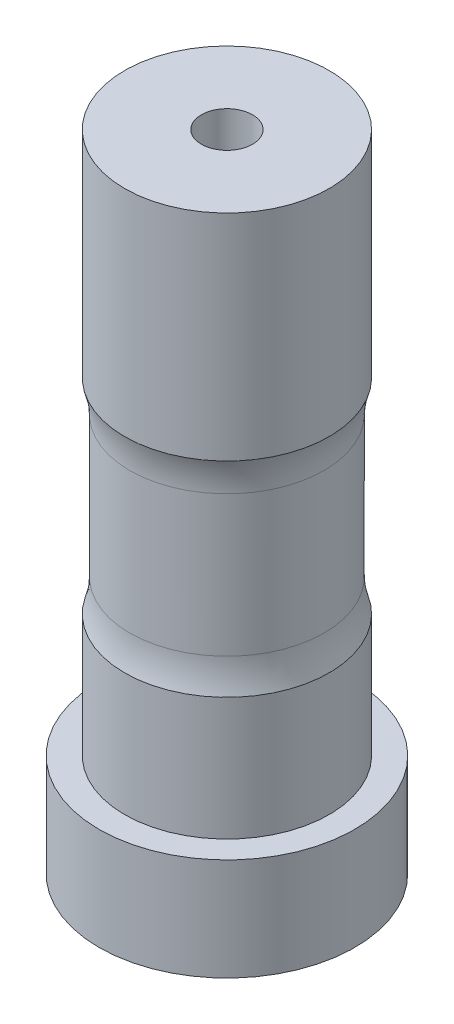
ISO-10303-21;
HEADER;
FILE_DESCRIPTION(('STEP AP214'),'2;1');
FILE_NAME('part.step','',(''),(''),'','','');
FILE_SCHEMA(('AUTOMOTIVE_DESIGN { 1 0 10303 214 1 1 1 1 }'));
ENDSEC;
DATA;
#1=APPLICATION_CONTEXT('core data for automotive mechanical design processes');
#2=APPLICATION_PROTOCOL_DEFINITION('international standard','automotive_design',2000,#1);
#3=PRODUCT_CONTEXT('',#1,'mechanical');
#4=PRODUCT('Part','Part','',(#3));
#5=PRODUCT_RELATED_PRODUCT_CATEGORY('part','',(#4));
#6=PRODUCT_DEFINITION_FORMATION('','',#4);
#7=PRODUCT_DEFINITION_CONTEXT('part definition',#1,'design');
#8=PRODUCT_DEFINITION('design','',#6,#7);
#9=PRODUCT_DEFINITION_SHAPE('','',#8);
#10=(LENGTH_UNIT() NAMED_UNIT(*) SI_UNIT(.MILLI.,.METRE.));
#11=(NAMED_UNIT(*) PLANE_ANGLE_UNIT() SI_UNIT($,.RADIAN.));
#12=(NAMED_UNIT(*) SI_UNIT($,.STERADIAN.) SOLID_ANGLE_UNIT());
#13=UNCERTAINTY_MEASURE_WITH_UNIT(LENGTH_MEASURE(1.E-05),#10,'distance_accuracy_value','');
#14=(GEOMETRIC_REPRESENTATION_CONTEXT(3) GLOBAL_UNCERTAINTY_ASSIGNED_CONTEXT((#13)) GLOBAL_UNIT_ASSIGNED_CONTEXT((#10,
#11,#12)) REPRESENTATION_CONTEXT('',''));
#15=CARTESIAN_POINT('',(0.,0.,0.));
#16=DIRECTION('',(0.,0.,1.));
#17=DIRECTION('',(1.,0.,0.));
#18=AXIS2_PLACEMENT_3D('',#15,#16,#17);
#19=CARTESIAN_POINT('',(0.,35.3991360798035,0.));
#20=DIRECTION('',(0.,1.,0.));
#21=DIRECTION('',(0.,0.,1.));
#22=AXIS2_PLACEMENT_3D('',#19,#20,#21);
#23=CYLINDRICAL_SURFACE('',#22,9.49999999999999);
#24=CARTESIAN_POINT('',(0.,-2.47836492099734,0.));
#25=DIRECTION('',(0.,-1.,0.));
#26=DIRECTION('',(0.,0.,-1.));
#27=AXIS2_PLACEMENT_3D('',#24,#25,#26);
#28=CIRCLE('',#27,9.49999999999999);
#29=CARTESIAN_POINT('',(0.,-2.47836492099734,-9.5));
#30=VERTEX_POINT('',#29);
#31=EDGE_CURVE('E11',#30,#30,#28,.F.);
#32=ORIENTED_EDGE('',*,*,#31,.T.);
#33=EDGE_LOOP('',(#32));
#34=FACE_BOUND('',#33,.T.);
#35=CARTESIAN_POINT('',(0.,11.2766370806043,0.));
#36=DIRECTION('',(0.,1.,0.));
#37=DIRECTION('',(0.,0.,1.));
#38=AXIS2_PLACEMENT_3D('',#35,#36,#37);
#39=CIRCLE('',#38,9.49999999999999);
#40=CARTESIAN_POINT('',(0.,11.2766370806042,9.49999999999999));
#41=VERTEX_POINT('',#40);
#42=EDGE_CURVE('E39',#41,#41,#39,.F.);
#43=ORIENTED_EDGE('',*,*,#42,.T.);
#44=EDGE_LOOP('',(#43));
#45=FACE_BOUND('',#44,.T.);
#46=ADVANCED_FACE('F32',(#34,#45),#23,.T.);
#47=CARTESIAN_POINT('',(0.,35.3991360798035,0.));
#48=DIRECTION('',(0.,1.,0.));
#49=DIRECTION('',(0.,0.,1.));
#50=AXIS2_PLACEMENT_3D('',#47,#48,#49);
#51=CYLINDRICAL_SURFACE('',#50,9.99999999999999);
#52=CARTESIAN_POINT('',(0.,-5.60086392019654,0.));
#53=DIRECTION('',(0.,1.,0.));
#54=DIRECTION('',(0.,0.,1.));
#55=AXIS2_PLACEMENT_3D('',#52,#53,#54);
#56=CIRCLE('',#55,10.);
#57=CARTESIAN_POINT('',(0.,-5.60086392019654,9.99999999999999));
#58=VERTEX_POINT('',#57);
#59=EDGE_CURVE('E77',#58,#58,#56,.T.);
#60=ORIENTED_EDGE('',*,*,#59,.F.);
#61=EDGE_LOOP('',(#60));
#62=FACE_BOUND('',#61,.T.);
#63=CARTESIAN_POINT('',(0.,-17.6008639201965,0.));
#64=DIRECTION('',(0.,1.,0.));
#65=DIRECTION('',(0.,0.,1.));
#66=AXIS2_PLACEMENT_3D('',#63,#64,#65);
#67=CIRCLE('',#66,9.99999999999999);
#68=CARTESIAN_POINT('',(0.,-17.6008639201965,9.99999999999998));
#69=VERTEX_POINT('',#68);
#70=EDGE_CURVE('E74',#69,#69,#67,.T.);
#71=ORIENTED_EDGE('',*,*,#70,.T.);
#72=EDGE_LOOP('',(#71));
#73=FACE_BOUND('',#72,.T.);
#74=ADVANCED_FACE('F103',(#62,#73),#51,.T.);
#75=CARTESIAN_POINT('',(0.,-17.6008639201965,-10.));
#76=DIRECTION('',(0.,-1.,0.));
#77=DIRECTION('',(0.,0.,-1.));
#78=AXIS2_PLACEMENT_3D('',#75,#76,#77);
#79=PLANE('',#78);
#80=ORIENTED_EDGE('',*,*,#70,.F.);
#81=EDGE_LOOP('',(#80));
#82=FACE_BOUND('',#81,.T.);
#83=CARTESIAN_POINT('',(0.,-17.6008639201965,0.));
#84=DIRECTION('',(0.,1.,0.));
#85=DIRECTION('',(0.,0.,1.));
#86=AXIS2_PLACEMENT_3D('',#83,#84,#85);
#87=CIRCLE('',#86,12.5);
#88=CARTESIAN_POINT('',(0.,-17.6008639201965,12.5));
#89=VERTEX_POINT('',#88);
#90=EDGE_CURVE('E71',#89,#89,#87,.T.);
#91=ORIENTED_EDGE('',*,*,#90,.T.);
#92=EDGE_LOOP('',(#91));
#93=FACE_BOUND('',#92,.T.);
#94=ADVANCED_FACE('F109',(#82,#93),#79,.F.);
#95=CARTESIAN_POINT('',(0.,35.3991360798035,0.));
#96=DIRECTION('',(0.,1.,0.));
#97=DIRECTION('',(0.,0.,1.));
#98=AXIS2_PLACEMENT_3D('',#95,#96,#97);
#99=CYLINDRICAL_SURFACE('',#98,12.5);
#100=ORIENTED_EDGE('',*,*,#90,.F.);
#101=EDGE_LOOP('',(#100));
#102=FACE_BOUND('',#101,.T.);
#103=CARTESIAN_POINT('',(0.,-27.6008639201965,0.));
#104=DIRECTION('',(0.,1.,0.));
#105=DIRECTION('',(0.,0.,1.));
#106=AXIS2_PLACEMENT_3D('',#103,#104,#105);
#107=CIRCLE('',#106,12.5);
#108=CARTESIAN_POINT('',(0.,-27.6008639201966,12.5));
#109=VERTEX_POINT('',#108);
#110=EDGE_CURVE('E68',#109,#109,#107,.T.);
#111=ORIENTED_EDGE('',*,*,#110,.T.);
#112=EDGE_LOOP('',(#111));
#113=FACE_BOUND('',#112,.T.);
#114=ADVANCED_FACE('F115',(#102,#113),#99,.T.);
#115=CARTESIAN_POINT('',(0.,-27.6008639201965,-12.5));
#116=DIRECTION('',(0.,1.,0.));
#117=DIRECTION('',(0.,0.,1.));
#118=AXIS2_PLACEMENT_3D('',#115,#116,#117);
#119=PLANE('',#118);
#120=ORIENTED_EDGE('',*,*,#110,.F.);
#121=EDGE_LOOP('',(#120));
#122=FACE_BOUND('',#121,.T.);
#123=CARTESIAN_POINT('',(0.,-27.6008639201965,0.));
#124=DIRECTION('',(0.,1.,0.));
#125=DIRECTION('',(0.,0.,1.));
#126=AXIS2_PLACEMENT_3D('',#123,#124,#125);
#127=CIRCLE('',#126,9.99999999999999);
#128=CARTESIAN_POINT('',(0.,-27.6008639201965,9.99999999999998));
#129=VERTEX_POINT('',#128);
#130=EDGE_CURVE('E65',#129,#129,#127,.T.);
#131=ORIENTED_EDGE('',*,*,#130,.T.);
#132=EDGE_LOOP('',(#131));
#133=FACE_BOUND('',#132,.T.);
#134=ADVANCED_FACE('F119',(#122,#133),#119,.F.);
#135=CARTESIAN_POINT('',(0.,35.3991360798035,0.));
#136=DIRECTION('',(0.,1.,0.));
#137=DIRECTION('',(0.,0.,1.));
#138=AXIS2_PLACEMENT_3D('',#135,#136,#137);
#139=CYLINDRICAL_SURFACE('',#138,9.99999999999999);
#140=ORIENTED_EDGE('',*,*,#130,.F.);
#141=EDGE_LOOP('',(#140));
#142=FACE_BOUND('',#141,.T.);
#143=CARTESIAN_POINT('',(0.,-29.1008639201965,0.));
#144=DIRECTION('',(0.,1.,0.));
#145=DIRECTION('',(0.,0.,1.));
#146=AXIS2_PLACEMENT_3D('',#143,#144,#145);
#147=CIRCLE('',#146,9.99999999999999);
#148=CARTESIAN_POINT('',(0.,-29.1008639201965,9.99999999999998));
#149=VERTEX_POINT('',#148);
#150=EDGE_CURVE('E62',#149,#149,#147,.T.);
#151=ORIENTED_EDGE('',*,*,#150,.T.);
#152=EDGE_LOOP('',(#151));
#153=FACE_BOUND('',#152,.T.);
#154=ADVANCED_FACE('F123',(#142,#153),#139,.T.);
#155=CARTESIAN_POINT('',(0.,-29.1008639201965,-10.));
#156=DIRECTION('',(0.,1.,0.));
#157=DIRECTION('',(0.,0.,1.));
#158=AXIS2_PLACEMENT_3D('',#155,#156,#157);
#159=PLANE('',#158);
#160=ORIENTED_EDGE('',*,*,#150,.F.);
#161=EDGE_LOOP('',(#160));
#162=FACE_BOUND('',#161,.T.);
#163=ADVANCED_FACE('F98',(#162),#159,.F.);
#164=CARTESIAN_POINT('',(0.,35.3991360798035,-10.));
#165=DIRECTION('',(0.,-1.,0.));
#166=DIRECTION('',(0.,0.,-1.));
#167=AXIS2_PLACEMENT_3D('',#164,#165,#166);
#168=PLANE('',#167);
#169=CARTESIAN_POINT('',(0.,35.3991360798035,0.));
#170=DIRECTION('',(0.,1.,0.));
#171=DIRECTION('',(0.,0.,1.));
#172=AXIS2_PLACEMENT_3D('',#169,#170,#171);
#173=CIRCLE('',#172,2.5);
#174=CARTESIAN_POINT('',(0.,35.3991360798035,2.5));
#175=VERTEX_POINT('',#174);
#176=EDGE_CURVE('E52',#175,#175,#173,.T.);
#177=ORIENTED_EDGE('',*,*,#176,.F.);
#178=EDGE_LOOP('',(#177));
#179=FACE_BOUND('',#178,.T.);
#180=CARTESIAN_POINT('',(0.,35.3991360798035,0.));
#181=DIRECTION('',(0.,1.,0.));
#182=DIRECTION('',(0.,0.,1.));
#183=AXIS2_PLACEMENT_3D('',#180,#181,#182);
#184=CIRCLE('',#183,10.);
#185=CARTESIAN_POINT('',(0.,35.3991360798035,10.));
#186=VERTEX_POINT('',#185);
#187=EDGE_CURVE('E55',#186,#186,#184,.T.);
#188=ORIENTED_EDGE('',*,*,#187,.T.);
#189=EDGE_LOOP('',(#188));
#190=FACE_BOUND('',#189,.T.);
#191=ADVANCED_FACE('F90',(#179,#190),#168,.F.);
#192=CARTESIAN_POINT('',(0.,35.3991360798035,0.));
#193=DIRECTION('',(0.,1.,0.));
#194=DIRECTION('',(0.,0.,1.));
#195=AXIS2_PLACEMENT_3D('',#192,#193,#194);
#196=CYLINDRICAL_SURFACE('',#195,9.99999999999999);
#197=ORIENTED_EDGE('',*,*,#187,.F.);
#198=EDGE_LOOP('',(#197));
#199=FACE_BOUND('',#198,.T.);
#200=CARTESIAN_POINT('',(0.,14.3991360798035,0.));
#201=DIRECTION('',(0.,1.,0.));
#202=DIRECTION('',(0.,0.,1.));
#203=AXIS2_PLACEMENT_3D('',#200,#201,#202);
#204=CIRCLE('',#203,9.99999999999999);
#205=CARTESIAN_POINT('',(0.,14.3991360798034,9.99999999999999));
#206=VERTEX_POINT('',#205);
#207=EDGE_CURVE('E51',#206,#206,#204,.T.);
#208=ORIENTED_EDGE('',*,*,#207,.T.);
#209=EDGE_LOOP('',(#208));
#210=FACE_BOUND('',#209,.T.);
#211=ADVANCED_FACE('F88',(#199,#210),#196,.T.);
#212=CARTESIAN_POINT('',(0.,-2.47836492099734,0.));
#213=DIRECTION('',(0.,-1.,0.));
#214=DIRECTION('',(0.,0.,-1.));
#215=AXIS2_PLACEMENT_3D('',#212,#213,#214);
#216=TOROIDAL_SURFACE('',#215,19.5,10.);
#217=ORIENTED_EDGE('',*,*,#59,.T.);
#218=EDGE_LOOP('',(#217));
#219=FACE_BOUND('',#218,.T.);
#220=ORIENTED_EDGE('',*,*,#31,.F.);
#221=EDGE_LOOP('',(#220));
#222=FACE_BOUND('',#221,.T.);
#223=ADVANCED_FACE('F85',(#219,#222),#216,.F.);
#224=CARTESIAN_POINT('',(0.,11.2766370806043,0.));
#225=DIRECTION('',(0.,1.,0.));
#226=DIRECTION('',(0.,0.,1.));
#227=AXIS2_PLACEMENT_3D('',#224,#225,#226);
#228=TOROIDAL_SURFACE('',#227,19.5,10.);
#229=ORIENTED_EDGE('',*,*,#42,.F.);
#230=EDGE_LOOP('',(#229));
#231=FACE_BOUND('',#230,.T.);
#232=ORIENTED_EDGE('',*,*,#207,.F.);
#233=EDGE_LOOP('',(#232));
#234=FACE_BOUND('',#233,.T.);
#235=ADVANCED_FACE('F34',(#231,#234),#228,.F.);
#236=CARTESIAN_POINT('',(0.,15.3991360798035,0.));
#237=DIRECTION('',(0.,1.,0.));
#238=DIRECTION('',(0.,0.,1.));
#239=AXIS2_PLACEMENT_3D('',#236,#237,#238);
#240=CONICAL_SURFACE('',#239,2.5,1.02974425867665);
#241=CARTESIAN_POINT('',(0.,13.8969845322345,0.));
#242=VERTEX_POINT('',#241);
#243=VERTEX_LOOP('',#242);
#244=FACE_BOUND('',#243,.T.);
#245=CARTESIAN_POINT('',(0.,15.3991360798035,0.));
#246=DIRECTION('',(0.,1.,0.));
#247=DIRECTION('',(0.,0.,1.));
#248=AXIS2_PLACEMENT_3D('',#245,#246,#247);
#249=CIRCLE('',#248,2.5);
#250=CARTESIAN_POINT('',(0.,15.3991360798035,2.49999999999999));
#251=VERTEX_POINT('',#250);
#252=EDGE_CURVE('E49',#251,#251,#249,.T.);
#253=ORIENTED_EDGE('',*,*,#252,.T.);
#254=EDGE_LOOP('',(#253));
#255=FACE_BOUND('',#254,.T.);
#256=ADVANCED_FACE('F42',(#244,#255),#240,.F.);
#257=CARTESIAN_POINT('',(0.,35.3991360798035,0.));
#258=DIRECTION('',(0.,1.,0.));
#259=DIRECTION('',(0.,0.,1.));
#260=AXIS2_PLACEMENT_3D('',#257,#258,#259);
#261=CYLINDRICAL_SURFACE('',#260,2.5);
#262=ORIENTED_EDGE('',*,*,#252,.F.);
#263=EDGE_LOOP('',(#262));
#264=FACE_BOUND('',#263,.T.);
#265=ORIENTED_EDGE('',*,*,#176,.T.);
#266=EDGE_LOOP('',(#265));
#267=FACE_BOUND('',#266,.T.);
#268=ADVANCED_FACE('F45',(#264,#267),#261,.F.);
#269=CLOSED_SHELL('',(#46,#74,#94,#114,#134,#154,#163,#191,#211,#223,#235,#256,#268));
#270=MANIFOLD_SOLID_BREP('B2',#269);
#271=ADVANCED_BREP_SHAPE_REPRESENTATION('',(#18,#270),#14);
#272=SHAPE_DEFINITION_REPRESENTATION(#9,#271);
ENDSEC;
END-ISO-10303-21;
